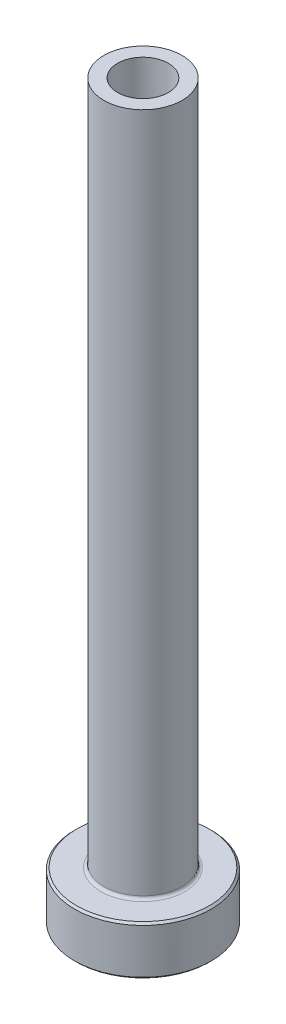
ISO-10303-21;
HEADER;
FILE_DESCRIPTION(('STEP AP214'),'2;1');
FILE_NAME('part.step','',(''),(''),'','','');
FILE_SCHEMA(('AUTOMOTIVE_DESIGN { 1 0 10303 214 1 1 1 1 }'));
ENDSEC;
DATA;
#1=APPLICATION_CONTEXT('core data for automotive mechanical design processes');
#2=APPLICATION_PROTOCOL_DEFINITION('international standard','automotive_design',2000,#1);
#3=PRODUCT_CONTEXT('',#1,'mechanical');
#4=PRODUCT('Part','Part','',(#3));
#5=PRODUCT_RELATED_PRODUCT_CATEGORY('part','',(#4));
#6=PRODUCT_DEFINITION_FORMATION('','',#4);
#7=PRODUCT_DEFINITION_CONTEXT('part definition',#1,'design');
#8=PRODUCT_DEFINITION('design','',#6,#7);
#9=PRODUCT_DEFINITION_SHAPE('','',#8);
#10=(LENGTH_UNIT() NAMED_UNIT(*) SI_UNIT(.MILLI.,.METRE.));
#11=(NAMED_UNIT(*) PLANE_ANGLE_UNIT() SI_UNIT($,.RADIAN.));
#12=(NAMED_UNIT(*) SI_UNIT($,.STERADIAN.) SOLID_ANGLE_UNIT());
#13=UNCERTAINTY_MEASURE_WITH_UNIT(LENGTH_MEASURE(1.E-05),#10,'distance_accuracy_value','');
#14=(GEOMETRIC_REPRESENTATION_CONTEXT(3) GLOBAL_UNCERTAINTY_ASSIGNED_CONTEXT((#13)) GLOBAL_UNIT_ASSIGNED_CONTEXT((#10,
#11,#12)) REPRESENTATION_CONTEXT('',''));
#15=CARTESIAN_POINT('',(0.,0.,0.));
#16=DIRECTION('',(0.,0.,1.));
#17=DIRECTION('',(1.,0.,0.));
#18=AXIS2_PLACEMENT_3D('',#15,#16,#17);
#19=CARTESIAN_POINT('',(0.,92.1876809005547,0.));
#20=DIRECTION('',(0.,1.,0.));
#21=DIRECTION('',(0.,0.,1.));
#22=AXIS2_PLACEMENT_3D('',#19,#20,#21);
#23=CYLINDRICAL_SURFACE('',#22,2.60000000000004);
#24=CARTESIAN_POINT('',(0.,75.,0.));
#25=DIRECTION('',(0.,1.,0.));
#26=DIRECTION('',(0.,0.,1.));
#27=AXIS2_PLACEMENT_3D('',#24,#25,#26);
#28=CIRCLE('',#27,2.60000000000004);
#29=CARTESIAN_POINT('',(0.,75.,2.60000000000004));
#30=VERTEX_POINT('',#29);
#31=EDGE_CURVE('E62',#30,#30,#28,.T.);
#32=ORIENTED_EDGE('',*,*,#31,.T.);
#33=EDGE_LOOP('',(#32));
#34=FACE_BOUND('',#33,.T.);
#35=CARTESIAN_POINT('',(0.,30.,0.));
#36=DIRECTION('',(0.,1.,0.));
#37=DIRECTION('',(0.,0.,1.));
#38=AXIS2_PLACEMENT_3D('',#35,#36,#37);
#39=CIRCLE('',#38,2.60000000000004);
#40=CARTESIAN_POINT('',(0.,30.,2.60000000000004));
#41=VERTEX_POINT('',#40);
#42=EDGE_CURVE('E71',#41,#41,#39,.T.);
#43=ORIENTED_EDGE('',*,*,#42,.F.);
#44=EDGE_LOOP('',(#43));
#45=FACE_BOUND('',#44,.T.);
#46=ADVANCED_FACE('F30',(#34,#45),#23,.F.);
#47=CARTESIAN_POINT('',(-2.60000000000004,75.,0.));
#48=DIRECTION('',(0.,1.,0.));
#49=DIRECTION('',(0.,0.,1.));
#50=AXIS2_PLACEMENT_3D('',#47,#48,#49);
#51=PLANE('',#50);
#52=CARTESIAN_POINT('',(0.,75.,0.));
#53=DIRECTION('',(0.,1.,0.));
#54=DIRECTION('',(0.,0.,1.));
#55=AXIS2_PLACEMENT_3D('',#52,#53,#54);
#56=CIRCLE('',#55,4.);
#57=CARTESIAN_POINT('',(0.,75.,4.));
#58=VERTEX_POINT('',#57);
#59=EDGE_CURVE('E65',#58,#58,#56,.T.);
#60=ORIENTED_EDGE('',*,*,#59,.T.);
#61=EDGE_LOOP('',(#60));
#62=FACE_BOUND('',#61,.T.);
#63=ORIENTED_EDGE('',*,*,#31,.F.);
#64=EDGE_LOOP('',(#63));
#65=FACE_BOUND('',#64,.T.);
#66=ADVANCED_FACE('F79',(#62,#65),#51,.T.);
#67=CARTESIAN_POINT('',(0.,92.1876809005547,0.));
#68=DIRECTION('',(0.,1.,0.));
#69=DIRECTION('',(0.,0.,1.));
#70=AXIS2_PLACEMENT_3D('',#67,#68,#69);
#71=CYLINDRICAL_SURFACE('',#70,3.99999999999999);
#72=CARTESIAN_POINT('',(0.,5.3,0.));
#73=DIRECTION('',(0.,1.,0.));
#74=DIRECTION('',(0.,0.,1.));
#75=AXIS2_PLACEMENT_3D('',#72,#73,#74);
#76=CIRCLE('',#75,3.99999999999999);
#77=CARTESIAN_POINT('',(0.,5.3,3.99999999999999));
#78=VERTEX_POINT('',#77);
#79=EDGE_CURVE('E59',#78,#78,#76,.T.);
#80=ORIENTED_EDGE('',*,*,#79,.T.);
#81=EDGE_LOOP('',(#80));
#82=FACE_BOUND('',#81,.T.);
#83=ORIENTED_EDGE('',*,*,#59,.F.);
#84=EDGE_LOOP('',(#83));
#85=FACE_BOUND('',#84,.T.);
#86=ADVANCED_FACE('F85',(#82,#85),#71,.T.);
#87=CARTESIAN_POINT('',(-3.99999999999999,5.,0.));
#88=DIRECTION('',(0.,1.,0.));
#89=DIRECTION('',(0.,0.,1.));
#90=AXIS2_PLACEMENT_3D('',#87,#88,#89);
#91=PLANE('',#90);
#92=CARTESIAN_POINT('',(0.,5.,0.));
#93=DIRECTION('',(0.,1.,0.));
#94=DIRECTION('',(0.,0.,1.));
#95=AXIS2_PLACEMENT_3D('',#92,#93,#94);
#96=CIRCLE('',#95,6.8);
#97=CARTESIAN_POINT('',(0.,5.,6.8));
#98=VERTEX_POINT('',#97);
#99=EDGE_CURVE('E53',#98,#98,#96,.T.);
#100=ORIENTED_EDGE('',*,*,#99,.T.);
#101=EDGE_LOOP('',(#100));
#102=FACE_BOUND('',#101,.T.);
#103=CARTESIAN_POINT('',(0.,5.,0.));
#104=DIRECTION('',(0.,1.,0.));
#105=DIRECTION('',(0.,0.,1.));
#106=AXIS2_PLACEMENT_3D('',#103,#104,#105);
#107=CIRCLE('',#106,4.29999999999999);
#108=CARTESIAN_POINT('',(0.,5.,4.29999999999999));
#109=VERTEX_POINT('',#108);
#110=EDGE_CURVE('E56',#109,#109,#107,.F.);
#111=ORIENTED_EDGE('',*,*,#110,.T.);
#112=EDGE_LOOP('',(#111));
#113=FACE_BOUND('',#112,.T.);
#114=ADVANCED_FACE('F111',(#102,#113),#91,.T.);
#115=CARTESIAN_POINT('',(0.,92.1876809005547,0.));
#116=DIRECTION('',(0.,1.,0.));
#117=DIRECTION('',(0.,0.,1.));
#118=AXIS2_PLACEMENT_3D('',#115,#116,#117);
#119=CYLINDRICAL_SURFACE('',#118,6.99999999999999);
#120=CARTESIAN_POINT('',(0.,4.8,0.));
#121=DIRECTION('',(0.,1.,0.));
#122=DIRECTION('',(0.,0.,1.));
#123=AXIS2_PLACEMENT_3D('',#120,#121,#122);
#124=CIRCLE('',#123,6.99999999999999);
#125=CARTESIAN_POINT('',(0.,4.8,6.99999999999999));
#126=VERTEX_POINT('',#125);
#127=EDGE_CURVE('E45',#126,#126,#124,.F.);
#128=ORIENTED_EDGE('',*,*,#127,.T.);
#129=EDGE_LOOP('',(#128));
#130=FACE_BOUND('',#129,.T.);
#131=CARTESIAN_POINT('',(0.,0.199999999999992,0.));
#132=DIRECTION('',(0.,-1.,0.));
#133=DIRECTION('',(0.,0.,-1.));
#134=AXIS2_PLACEMENT_3D('',#131,#132,#133);
#135=CIRCLE('',#134,6.99999999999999);
#136=CARTESIAN_POINT('',(0.,0.199999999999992,-6.99999999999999));
#137=VERTEX_POINT('',#136);
#138=EDGE_CURVE('E50',#137,#137,#135,.F.);
#139=ORIENTED_EDGE('',*,*,#138,.T.);
#140=EDGE_LOOP('',(#139));
#141=FACE_BOUND('',#140,.T.);
#142=ADVANCED_FACE('F108',(#130,#141),#119,.T.);
#143=CARTESIAN_POINT('',(-6.99999999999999,0.,0.));
#144=DIRECTION('',(0.,-1.,0.));
#145=DIRECTION('',(0.,0.,-1.));
#146=AXIS2_PLACEMENT_3D('',#143,#144,#145);
#147=PLANE('',#146);
#148=CARTESIAN_POINT('',(0.,0.,0.));
#149=DIRECTION('',(0.,-1.,0.));
#150=DIRECTION('',(0.,0.,-1.));
#151=AXIS2_PLACEMENT_3D('',#148,#149,#150);
#152=CIRCLE('',#151,3.34999999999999);
#153=CARTESIAN_POINT('',(0.,0.,-3.34999999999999));
#154=VERTEX_POINT('',#153);
#155=EDGE_CURVE('E37',#154,#154,#152,.F.);
#156=ORIENTED_EDGE('',*,*,#155,.T.);
#157=EDGE_LOOP('',(#156));
#158=FACE_BOUND('',#157,.T.);
#159=CARTESIAN_POINT('',(0.,0.,0.));
#160=DIRECTION('',(0.,-1.,0.));
#161=DIRECTION('',(0.,0.,-1.));
#162=AXIS2_PLACEMENT_3D('',#159,#160,#161);
#163=CIRCLE('',#162,6.80000000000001);
#164=CARTESIAN_POINT('',(0.,0.,-6.80000000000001));
#165=VERTEX_POINT('',#164);
#166=EDGE_CURVE('E41',#165,#165,#163,.T.);
#167=ORIENTED_EDGE('',*,*,#166,.T.);
#168=EDGE_LOOP('',(#167));
#169=FACE_BOUND('',#168,.T.);
#170=ADVANCED_FACE('F110',(#158,#169),#147,.T.);
#171=CARTESIAN_POINT('',(0.,92.1876809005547,0.));
#172=DIRECTION('',(0.,1.,0.));
#173=DIRECTION('',(0.,0.,1.));
#174=AXIS2_PLACEMENT_3D('',#171,#172,#173);
#175=CYLINDRICAL_SURFACE('',#174,2.84999999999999);
#176=CARTESIAN_POINT('',(0.,0.5,0.));
#177=DIRECTION('',(0.,-1.,0.));
#178=DIRECTION('',(0.,0.,-1.));
#179=AXIS2_PLACEMENT_3D('',#176,#177,#178);
#180=CIRCLE('',#179,2.84999999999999);
#181=CARTESIAN_POINT('',(0.,0.5,-2.84999999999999));
#182=VERTEX_POINT('',#181);
#183=EDGE_CURVE('E10',#182,#182,#180,.T.);
#184=ORIENTED_EDGE('',*,*,#183,.T.);
#185=EDGE_LOOP('',(#184));
#186=FACE_BOUND('',#185,.T.);
#187=CARTESIAN_POINT('',(0.,18.,0.));
#188=DIRECTION('',(0.,1.,0.));
#189=DIRECTION('',(0.,0.,1.));
#190=AXIS2_PLACEMENT_3D('',#187,#188,#189);
#191=CIRCLE('',#190,2.84999999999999);
#192=CARTESIAN_POINT('',(0.,18.,2.84999999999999));
#193=VERTEX_POINT('',#192);
#194=EDGE_CURVE('E68',#193,#193,#191,.T.);
#195=ORIENTED_EDGE('',*,*,#194,.T.);
#196=EDGE_LOOP('',(#195));
#197=FACE_BOUND('',#196,.T.);
#198=ADVANCED_FACE('F118',(#186,#197),#175,.F.);
#199=CARTESIAN_POINT('',(0.,18.,0.));
#200=DIRECTION('',(0.,-1.,0.));
#201=DIRECTION('',(0.,0.,-1.));
#202=AXIS2_PLACEMENT_3D('',#199,#200,#201);
#203=CONICAL_SURFACE('',#202,2.84999999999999,0.0208303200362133);
#204=ORIENTED_EDGE('',*,*,#42,.T.);
#205=EDGE_LOOP('',(#204));
#206=FACE_BOUND('',#205,.T.);
#207=ORIENTED_EDGE('',*,*,#194,.F.);
#208=EDGE_LOOP('',(#207));
#209=FACE_BOUND('',#208,.T.);
#210=ADVANCED_FACE('F75',(#206,#209),#203,.F.);
#211=CARTESIAN_POINT('',(0.,5.3,0.));
#212=DIRECTION('',(0.,1.,0.));
#213=DIRECTION('',(0.,0.,1.));
#214=AXIS2_PLACEMENT_3D('',#211,#212,#213);
#215=TOROIDAL_SURFACE('',#214,4.29999999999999,0.3);
#216=ORIENTED_EDGE('',*,*,#110,.F.);
#217=EDGE_LOOP('',(#216));
#218=FACE_BOUND('',#217,.T.);
#219=ORIENTED_EDGE('',*,*,#79,.F.);
#220=EDGE_LOOP('',(#219));
#221=FACE_BOUND('',#220,.T.);
#222=ADVANCED_FACE('F90',(#218,#221),#215,.F.);
#223=CARTESIAN_POINT('',(0.,5.,0.));
#224=DIRECTION('',(0.,-1.,0.));
#225=DIRECTION('',(0.,0.,-1.));
#226=AXIS2_PLACEMENT_3D('',#223,#224,#225);
#227=CONICAL_SURFACE('',#226,6.79999999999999,0.785398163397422);
#228=ORIENTED_EDGE('',*,*,#127,.F.);
#229=EDGE_LOOP('',(#228));
#230=FACE_BOUND('',#229,.T.);
#231=ORIENTED_EDGE('',*,*,#99,.F.);
#232=EDGE_LOOP('',(#231));
#233=FACE_BOUND('',#232,.T.);
#234=ADVANCED_FACE('F93',(#230,#233),#227,.T.);
#235=CARTESIAN_POINT('',(0.,0.199999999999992,0.));
#236=DIRECTION('',(0.,1.,0.));
#237=DIRECTION('',(0.,0.,1.));
#238=AXIS2_PLACEMENT_3D('',#235,#236,#237);
#239=CONICAL_SURFACE('',#238,6.99999999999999,0.785398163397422);
#240=ORIENTED_EDGE('',*,*,#166,.F.);
#241=EDGE_LOOP('',(#240));
#242=FACE_BOUND('',#241,.T.);
#243=ORIENTED_EDGE('',*,*,#138,.F.);
#244=EDGE_LOOP('',(#243));
#245=FACE_BOUND('',#244,.T.);
#246=ADVANCED_FACE('F96',(#242,#245),#239,.T.);
#247=CARTESIAN_POINT('',(0.,0.,0.));
#248=DIRECTION('',(0.,-1.,0.));
#249=DIRECTION('',(0.,0.,-1.));
#250=AXIS2_PLACEMENT_3D('',#247,#248,#249);
#251=CONICAL_SURFACE('',#250,3.34999999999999,0.785398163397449);
#252=ORIENTED_EDGE('',*,*,#183,.F.);
#253=EDGE_LOOP('',(#252));
#254=FACE_BOUND('',#253,.T.);
#255=ORIENTED_EDGE('',*,*,#155,.F.);
#256=EDGE_LOOP('',(#255));
#257=FACE_BOUND('',#256,.T.);
#258=ADVANCED_FACE('F32',(#254,#257),#251,.F.);
#259=CLOSED_SHELL('',(#46,#66,#86,#114,#142,#170,#198,#210,#222,#234,#246,#258));
#260=MANIFOLD_SOLID_BREP('B2',#259);
#261=ADVANCED_BREP_SHAPE_REPRESENTATION('',(#18,#260),#14);
#262=SHAPE_DEFINITION_REPRESENTATION(#9,#261);
ENDSEC;
END-ISO-10303-21;
